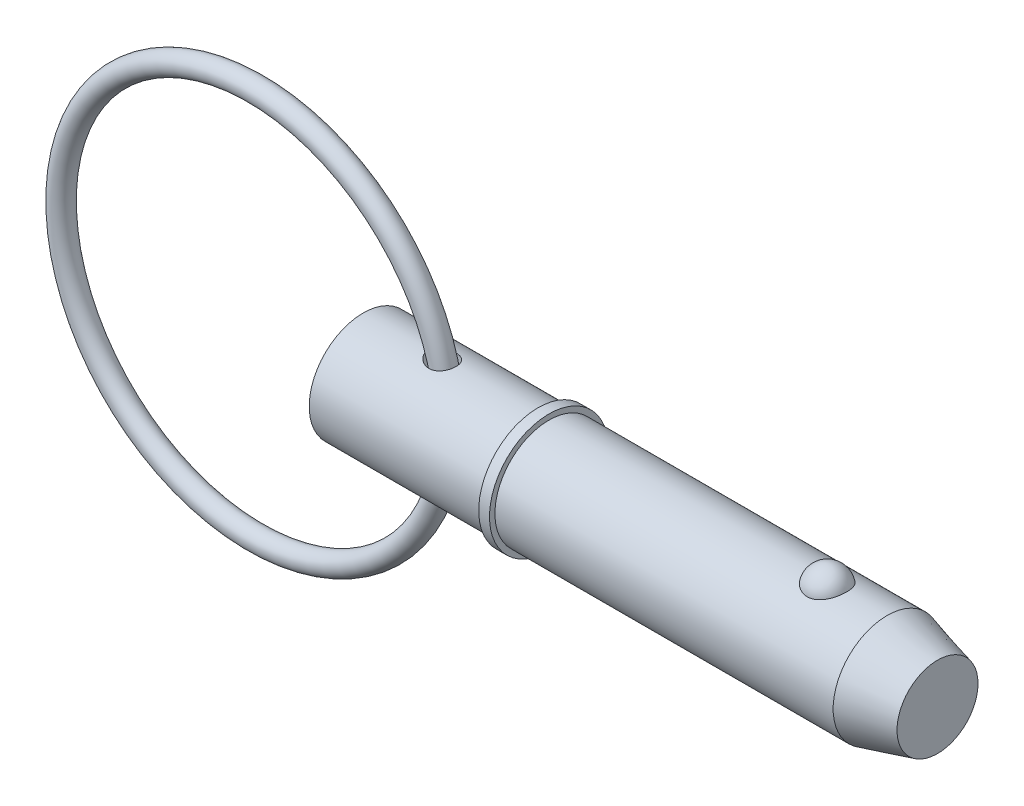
ISO-10303-21;
HEADER;
FILE_DESCRIPTION(('STEP AP214'),'2;1');
FILE_NAME('part.step','',(''),(''),'','','');
FILE_SCHEMA(('AUTOMOTIVE_DESIGN { 1 0 10303 214 1 1 1 1 }'));
ENDSEC;
DATA;
#1=APPLICATION_CONTEXT('core data for automotive mechanical design processes');
#2=APPLICATION_PROTOCOL_DEFINITION('international standard','automotive_design',2000,#1);
#3=PRODUCT_CONTEXT('',#1,'mechanical');
#4=PRODUCT('Part','Part','',(#3));
#5=PRODUCT_RELATED_PRODUCT_CATEGORY('part','',(#4));
#6=PRODUCT_DEFINITION_FORMATION('','',#4);
#7=PRODUCT_DEFINITION_CONTEXT('part definition',#1,'design');
#8=PRODUCT_DEFINITION('design','',#6,#7);
#9=PRODUCT_DEFINITION_SHAPE('','',#8);
#10=(LENGTH_UNIT() NAMED_UNIT(*) SI_UNIT(.MILLI.,.METRE.));
#11=(NAMED_UNIT(*) PLANE_ANGLE_UNIT() SI_UNIT($,.RADIAN.));
#12=(NAMED_UNIT(*) SI_UNIT($,.STERADIAN.) SOLID_ANGLE_UNIT());
#13=UNCERTAINTY_MEASURE_WITH_UNIT(LENGTH_MEASURE(1.E-05),#10,'distance_accuracy_value','');
#14=(GEOMETRIC_REPRESENTATION_CONTEXT(3) GLOBAL_UNCERTAINTY_ASSIGNED_CONTEXT((#13)) GLOBAL_UNIT_ASSIGNED_CONTEXT((#10,
#11,#12)) REPRESENTATION_CONTEXT('',''));
#15=CARTESIAN_POINT('',(0.,0.,0.));
#16=DIRECTION('',(0.,0.,1.));
#17=DIRECTION('',(1.,0.,0.));
#18=AXIS2_PLACEMENT_3D('',#15,#16,#17);
#19=CARTESIAN_POINT('',(-15.855506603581,0.,0.));
#20=DIRECTION('',(0.,0.,1.));
#21=DIRECTION('',(1.,0.,0.));
#22=AXIS2_PLACEMENT_3D('',#19,#20,#21);
#23=TOROIDAL_SURFACE('',#22,28.575,1.588);
#24=CARTESIAN_POINT('',(14.307493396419,0.,0.));
#25=VERTEX_POINT('',#24);
#26=VERTEX_LOOP('',#25);
#27=FACE_BOUND('',#26,.T.);
#28=ADVANCED_FACE('P0_F12',(#27),#23,.T.);
#29=CLOSED_SHELL('',(#28));
#30=MANIFOLD_SOLID_BREP('P0_B1',#29);
#31=CARTESIAN_POINT('',(0.,0.,0.));
#32=DIRECTION('',(1.,0.,0.));
#33=DIRECTION('',(0.,0.,-1.));
#34=AXIS2_PLACEMENT_3D('',#31,#32,#33);
#35=CYLINDRICAL_SURFACE('',#34,7.94);
#36=CARTESIAN_POINT('',(9.9064878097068,7.86092706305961,-1.11777712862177));
#37=CARTESIAN_POINT('',(9.98046148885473,7.84701054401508,-1.21564239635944));
#38=CARTESIAN_POINT('',(10.0632949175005,7.83217804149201,-1.30680329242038));
#39=CARTESIAN_POINT('',(10.243327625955,7.80247884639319,-1.47382688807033));
#40=CARTESIAN_POINT('',(10.3405572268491,7.78761214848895,-1.54965647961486));
#41=CARTESIAN_POINT('',(10.5460150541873,7.75960959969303,-1.6842723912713));
#42=CARTESIAN_POINT('',(10.654212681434,7.74646915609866,-1.74310445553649));
#43=CARTESIAN_POINT('',(10.8789333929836,7.72340979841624,-1.84259563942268));
#44=CARTESIAN_POINT('',(10.9954527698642,7.71348946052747,-1.88326279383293));
#45=CARTESIAN_POINT('',(11.2371543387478,7.69793327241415,-1.94589519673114));
#46=CARTESIAN_POINT('',(11.3624861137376,7.69242163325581,-1.96732022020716));
#47=CARTESIAN_POINT('',(11.6151110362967,7.68708151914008,-1.98809161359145));
#48=CARTESIAN_POINT('',(11.7424035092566,7.68725113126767,-1.98744541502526));
#49=CARTESIAN_POINT('',(11.9871377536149,7.69329740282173,-1.96389977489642));
#50=CARTESIAN_POINT('',(12.1047148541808,7.69883374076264,-1.94232728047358));
#51=CARTESIAN_POINT('',(12.3339179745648,7.7145667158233,-1.87886184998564));
#52=CARTESIAN_POINT('',(12.445546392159,7.72476145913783,-1.83697717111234));
#53=CARTESIAN_POINT('',(12.6521036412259,7.7477815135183,-1.73721211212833));
#54=CARTESIAN_POINT('',(12.7476463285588,7.76039274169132,-1.68054854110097));
#55=CARTESIAN_POINT('',(12.9274536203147,7.7871582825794,-1.55179691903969));
#56=CARTESIAN_POINT('',(13.0117191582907,7.8013124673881,-1.47971014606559));
#57=CARTESIAN_POINT('',(13.16544092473,7.82932755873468,-1.32341211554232));
#58=CARTESIAN_POINT('',(13.2351086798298,7.84318958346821,-1.23940873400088));
#59=CARTESIAN_POINT('',(13.3595610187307,7.86933512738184,-1.06080152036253));
#60=CARTESIAN_POINT('',(13.4143450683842,7.88161858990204,-0.966197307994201));
#61=CARTESIAN_POINT('',(13.5082288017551,7.90340571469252,-0.767990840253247));
#62=CARTESIAN_POINT('',(13.5471601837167,7.91287927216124,-0.664305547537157));
#63=CARTESIAN_POINT('',(13.6076213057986,7.92785679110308,-0.451705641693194));
#64=CARTESIAN_POINT('',(13.6291504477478,7.93336061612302,-0.342790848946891));
#65=CARTESIAN_POINT('',(13.6544025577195,7.93983472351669,-0.12204266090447));
#66=CARTESIAN_POINT('',(13.6580055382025,7.94077445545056,-0.0101946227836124));
#67=CARTESIAN_POINT('',(13.6469977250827,7.93793630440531,0.212542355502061));
#68=CARTESIAN_POINT('',(13.6323866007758,7.93415833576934,0.323431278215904));
#69=CARTESIAN_POINT('',(13.5852649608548,7.92228583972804,0.541194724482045));
#70=CARTESIAN_POINT('',(13.5527398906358,7.91418780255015,0.648065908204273));
#71=CARTESIAN_POINT('',(13.4705326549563,7.8945509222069,0.854658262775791));
#72=CARTESIAN_POINT('',(13.4208502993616,7.88301204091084,0.954379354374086));
#73=CARTESIAN_POINT('',(13.3056021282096,7.85778224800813,1.14366619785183));
#74=CARTESIAN_POINT('',(13.2400609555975,7.8440946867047,1.23324739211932));
#75=CARTESIAN_POINT('',(13.0946981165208,7.8160855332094,1.39984119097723));
#76=CARTESIAN_POINT('',(13.0148777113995,7.80176399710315,1.47685490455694));
#77=CARTESIAN_POINT('',(12.8438529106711,7.774237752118,1.61548556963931));
#78=CARTESIAN_POINT('',(12.7527554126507,7.76102428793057,1.67723263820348));
#79=CARTESIAN_POINT('',(12.5611987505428,7.73705789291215,1.78453696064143));
#80=CARTESIAN_POINT('',(12.4607407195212,7.72630466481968,1.83009617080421));
#81=CARTESIAN_POINT('',(12.2541997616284,7.70849465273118,1.90371822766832));
#82=CARTESIAN_POINT('',(12.1481665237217,7.7014098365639,1.93191408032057));
#83=CARTESIAN_POINT('',(11.9327851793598,7.69148605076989,1.97105353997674));
#84=CARTESIAN_POINT('',(11.8234367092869,7.68864754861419,1.98199524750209));
#85=CARTESIAN_POINT('',(11.6016024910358,7.68735890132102,1.98698770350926));
#86=CARTESIAN_POINT('',(11.4891069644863,7.68902083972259,1.98060702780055));
#87=CARTESIAN_POINT('',(11.2665484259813,7.6966276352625,1.95083303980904));
#88=CARTESIAN_POINT('',(11.1564861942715,7.70257384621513,1.92743434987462));
#89=CARTESIAN_POINT('',(10.9339966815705,7.71853798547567,1.86251478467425));
#90=CARTESIAN_POINT('',(10.8219140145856,7.72880438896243,1.81987394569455));
#91=CARTESIAN_POINT('',(10.6060441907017,7.75216432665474,1.7176403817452));
#92=CARTESIAN_POINT('',(10.5022611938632,7.76525926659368,1.65803922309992));
#93=CARTESIAN_POINT('',(10.3000447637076,7.79362794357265,1.51929354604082));
#94=CARTESIAN_POINT('',(10.2022480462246,7.80898310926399,1.43923272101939));
#95=CARTESIAN_POINT('',(10.0221668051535,7.83939672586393,1.26310118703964));
#96=CARTESIAN_POINT('',(9.93988168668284,7.85445518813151,1.16703109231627));
#97=CARTESIAN_POINT('',(9.79729823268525,7.88178950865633,0.964874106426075));
#98=CARTESIAN_POINT('',(9.73627994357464,7.89414970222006,0.859310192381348));
#99=CARTESIAN_POINT('',(9.63554001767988,7.91508909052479,0.638143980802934));
#100=CARTESIAN_POINT('',(9.59578986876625,7.92367334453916,0.522555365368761));
#101=CARTESIAN_POINT('',(9.54388714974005,7.93499161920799,0.300466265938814));
#102=CARTESIAN_POINT('',(9.52888458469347,7.93832727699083,0.194660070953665));
#103=CARTESIAN_POINT('',(9.51823078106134,7.94068976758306,-0.0179747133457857));
#104=CARTESIAN_POINT('',(9.52257317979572,7.93971801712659,-0.12480295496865));
#105=CARTESIAN_POINT('',(9.54911264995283,7.93386114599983,-0.326814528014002));
#106=CARTESIAN_POINT('',(9.56976509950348,7.92931471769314,-0.422217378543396));
#107=CARTESIAN_POINT('',(9.62591284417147,7.91721462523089,-0.608271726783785));
#108=CARTESIAN_POINT('',(9.66139801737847,7.90966301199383,-0.698926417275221));
#109=CARTESIAN_POINT('',(9.7317197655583,7.89515389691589,-0.844763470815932));
#110=CARTESIAN_POINT('',(9.76292633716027,7.88881879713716,-0.901801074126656));
#111=CARTESIAN_POINT('',(9.83075962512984,7.87538342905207,-1.01244242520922));
#112=CARTESIAN_POINT('',(9.86738597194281,7.86828321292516,-1.06604640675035));
#113=CARTESIAN_POINT('',(9.9064878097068,7.86092706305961,-1.11777712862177));
#114=B_SPLINE_CURVE_WITH_KNOTS('',3,(#36,#37,#38,#39,#40,#41,#42,#43,#44,#45,#46,#47,#48,#49,
#50,#51,#52,#53,#54,#55,#56,#57,#58,#59,#60,#61,#62,#63,#64,#65,#66,#67,#68,#69,#70,#71,#72,#73,
#74,#75,#76,#77,#78,#79,#80,#81,#82,#83,#84,#85,#86,#87,#88,#89,#90,#91,#92,#93,#94,#95,#96,#97,
#98,#99,#100,#101,#102,#103,#104,#105,#106,#107,#108,#109,#110,#111,#112,#113),.UNSPECIFIED.,
.T.,.F.,(4,2,2,2,2,2,2,2,2,2,2,2,2,2,2,2,2,2,2,2,2,2,2,2,2,2,2,2,2,2,2,2,2,2,2,2,2,2,4),(0.,
0.370138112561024,0.741067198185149,1.11098852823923,1.48074607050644,1.86058657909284,
2.24029919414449,2.59740885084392,2.95437345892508,3.2881332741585,3.6218654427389,
3.95036374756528,4.27887384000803,4.61078596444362,4.94270949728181,5.27685177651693,
5.61100012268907,5.94542035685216,6.27984429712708,6.61375187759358,6.94762997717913,
7.27855592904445,7.60944187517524,7.93776058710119,8.26611544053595,8.60272268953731,
8.93943635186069,9.29895306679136,9.65864886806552,10.0387340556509,10.4188046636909,
10.7843533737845,11.1494107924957,11.4683925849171,11.7872694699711,12.0791172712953,
12.3707662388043,12.5664313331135,12.7620830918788),.UNSPECIFIED.);
#115=CARTESIAN_POINT('',(9.9064878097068,7.86092706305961,-1.11777712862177));
#116=VERTEX_POINT('',#115);
#117=EDGE_CURVE('P1_E42',#116,#116,#114,.T.);
#118=ORIENTED_EDGE('',*,*,#117,.T.);
#119=EDGE_LOOP('',(#118));
#120=FACE_BOUND('',#119,.T.);
#121=CARTESIAN_POINT('',(0.,0.,0.));
#122=DIRECTION('',(1.,0.,0.));
#123=DIRECTION('',(0.,0.,-1.));
#124=AXIS2_PLACEMENT_3D('',#121,#122,#123);
#125=CIRCLE('',#124,7.94);
#126=CARTESIAN_POINT('',(0.,0.,-7.94));
#127=VERTEX_POINT('',#126);
#128=EDGE_CURVE('P1_E9',#127,#127,#125,.T.);
#129=ORIENTED_EDGE('',*,*,#128,.T.);
#130=EDGE_LOOP('',(#129));
#131=FACE_BOUND('',#130,.T.);
#132=CARTESIAN_POINT('',(25.722,0.,0.));
#133=DIRECTION('',(1.,0.,0.));
#134=DIRECTION('',(0.,0.,-1.));
#135=AXIS2_PLACEMENT_3D('',#132,#133,#134);
#136=CIRCLE('',#135,7.94);
#137=CARTESIAN_POINT('',(25.722,0.,-7.94));
#138=VERTEX_POINT('',#137);
#139=EDGE_CURVE('P1_E25',#138,#138,#136,.T.);
#140=ORIENTED_EDGE('',*,*,#139,.F.);
#141=EDGE_LOOP('',(#140));
#142=FACE_BOUND('',#141,.T.);
#143=CARTESIAN_POINT('',(9.9064878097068,-7.86092706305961,-1.11777712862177));
#144=CARTESIAN_POINT('',(9.84378768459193,-7.87272256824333,-1.03482250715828));
#145=CARTESIAN_POINT('',(9.7874122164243,-7.88386682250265,-0.947002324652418));
#146=CARTESIAN_POINT('',(9.68947008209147,-7.90377389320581,-0.763202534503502));
#147=CARTESIAN_POINT('',(9.64789384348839,-7.91253824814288,-0.667228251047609));
#148=CARTESIAN_POINT('',(9.58141396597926,-7.92676779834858,-0.468898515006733));
#149=CARTESIAN_POINT('',(9.55658638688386,-7.93221793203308,-0.366516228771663));
#150=CARTESIAN_POINT('',(9.525398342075,-7.9390896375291,-0.158837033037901));
#151=CARTESIAN_POINT('',(9.51903196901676,-7.94051249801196,-0.0535410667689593));
#152=CARTESIAN_POINT('',(9.5249639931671,-7.93919670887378,0.149856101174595));
#153=CARTESIAN_POINT('',(9.53611757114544,-7.9367132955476,0.247994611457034));
#154=CARTESIAN_POINT('',(9.57435037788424,-7.92833496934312,0.440949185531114));
#155=CARTESIAN_POINT('',(9.60143086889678,-7.92243978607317,0.535764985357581));
#156=CARTESIAN_POINT('',(9.67027872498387,-7.90782830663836,0.720026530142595));
#157=CARTESIAN_POINT('',(9.71210005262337,-7.89910165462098,0.809451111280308));
#158=CARTESIAN_POINT('',(9.80864905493,-7.87966534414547,0.980775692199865));
#159=CARTESIAN_POINT('',(9.86338092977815,-7.86895504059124,1.06267323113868));
#160=CARTESIAN_POINT('',(9.99009906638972,-7.84531573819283,1.22559225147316));
#161=CARTESIAN_POINT('',(10.0632770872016,-7.8322718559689,1.30566871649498));
#162=CARTESIAN_POINT('',(10.2208237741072,-7.80611237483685,1.45392159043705));
#163=CARTESIAN_POINT('',(10.3051986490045,-7.79299674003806,1.52209134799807));
#164=CARTESIAN_POINT('',(10.4935539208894,-7.76638841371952,1.65280871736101));
#165=CARTESIAN_POINT('',(10.5986730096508,-7.75303312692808,1.71374951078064));
#166=CARTESIAN_POINT('',(10.8175805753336,-7.72920597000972,1.81820073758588));
#167=CARTESIAN_POINT('',(10.9313721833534,-7.71873514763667,1.86170483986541));
#168=CARTESIAN_POINT('',(11.1696833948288,-7.70161777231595,1.93133079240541));
#169=CARTESIAN_POINT('',(11.2944525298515,-7.69514907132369,1.95665138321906));
#170=CARTESIAN_POINT('',(11.5466607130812,-7.6877908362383,1.98537345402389));
#171=CARTESIAN_POINT('',(11.6740986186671,-7.68689896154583,1.98878412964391));
#172=CARTESIAN_POINT('',(11.9206005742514,-7.690938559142,1.97309854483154));
#173=CARTESIAN_POINT('',(12.0397453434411,-7.69555832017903,1.95520713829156));
#174=CARTESIAN_POINT('',(12.2727177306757,-7.70968728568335,1.89872693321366));
#175=CARTESIAN_POINT('',(12.3865475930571,-7.71919440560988,1.86014695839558));
#176=CARTESIAN_POINT('',(12.5975118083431,-7.74115679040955,1.76641559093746));
#177=CARTESIAN_POINT('',(12.6952552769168,-7.75336701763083,1.71257254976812));
#178=CARTESIAN_POINT('',(12.8798510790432,-7.77962828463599,1.58901145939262));
#179=CARTESIAN_POINT('',(12.9667044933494,-7.79367914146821,1.51929498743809));
#180=CARTESIAN_POINT('',(13.1254818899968,-7.82172079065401,1.36751778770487));
#181=CARTESIAN_POINT('',(13.1976693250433,-7.83570718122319,1.28573131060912));
#182=CARTESIAN_POINT('',(13.3274495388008,-7.86236718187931,1.11111271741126));
#183=CARTESIAN_POINT('',(13.3850418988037,-7.87504075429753,1.01828028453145));
#184=CARTESIAN_POINT('',(13.4847470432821,-7.89782512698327,0.823214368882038));
#185=CARTESIAN_POINT('',(13.5267056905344,-7.90791011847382,0.720899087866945));
#186=CARTESIAN_POINT('',(13.5933891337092,-7.92427335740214,0.510509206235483));
#187=CARTESIAN_POINT('',(13.6181132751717,-7.9305514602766,0.402434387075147));
#188=CARTESIAN_POINT('',(13.6498843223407,-7.93866355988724,0.182728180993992));
#189=CARTESIAN_POINT('',(13.6567982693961,-7.94046412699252,0.07107630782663));
#190=CARTESIAN_POINT('',(13.6524060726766,-7.93933046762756,-0.151845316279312));
#191=CARTESIAN_POINT('',(13.6410996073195,-7.93639615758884,-0.26311506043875));
#192=CARTESIAN_POINT('',(13.6005023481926,-7.92610202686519,-0.482238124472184));
#193=CARTESIAN_POINT('',(13.571192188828,-7.91873744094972,-0.590087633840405));
#194=CARTESIAN_POINT('',(13.495246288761,-7.90037565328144,-0.799178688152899));
#195=CARTESIAN_POINT('',(13.4486102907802,-7.88937839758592,-0.900420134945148));
#196=CARTESIAN_POINT('',(13.3391817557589,-7.86497175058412,-1.09328280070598));
#197=CARTESIAN_POINT('',(13.2764083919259,-7.85156522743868,-1.18491525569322));
#198=CARTESIAN_POINT('',(13.1362355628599,-7.8238261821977,-1.35604994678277));
#199=CARTESIAN_POINT('',(13.0588372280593,-7.80949373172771,-1.43555311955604));
#200=CARTESIAN_POINT('',(12.8921392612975,-7.78164292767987,-1.57955181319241));
#201=CARTESIAN_POINT('',(12.8029410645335,-7.76811892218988,-1.64416363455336));
#202=CARTESIAN_POINT('',(12.6146622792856,-7.74328422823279,-1.75742016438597));
#203=CARTESIAN_POINT('',(12.5155829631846,-7.73197325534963,-1.80606692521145));
#204=CARTESIAN_POINT('',(12.31135301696,-7.71289290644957,-1.88588502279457));
#205=CARTESIAN_POINT('',(12.2062651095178,-7.70509254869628,-1.91720981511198));
#206=CARTESIAN_POINT('',(11.9922253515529,-7.69365188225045,-1.96261878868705));
#207=CARTESIAN_POINT('',(11.8832731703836,-7.69001193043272,-1.97670149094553));
#208=CARTESIAN_POINT('',(11.662174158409,-7.6871142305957,-1.98794112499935));
#209=CARTESIAN_POINT('',(11.5500082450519,-7.6879499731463,-1.98473694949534));
#210=CARTESIAN_POINT('',(11.3276038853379,-7.69396349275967,-1.96129119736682));
#211=CARTESIAN_POINT('',(11.2173659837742,-7.6991424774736,-1.94104488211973));
#212=CARTESIAN_POINT('',(10.9943151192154,-7.71363470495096,-1.8826578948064));
#213=CARTESIAN_POINT('',(10.8818004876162,-7.72319478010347,-1.8434396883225));
#214=CARTESIAN_POINT('',(10.6644693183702,-7.74534199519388,-1.74804607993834));
#215=CARTESIAN_POINT('',(10.5596578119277,-7.75793109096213,-1.69185971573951));
#216=CARTESIAN_POINT('',(10.3538333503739,-7.78563853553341,-1.5595801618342));
#217=CARTESIAN_POINT('',(10.2535123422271,-7.80086820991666,-1.48242881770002));
#218=CARTESIAN_POINT('',(10.0678634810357,-7.83136022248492,-1.31182139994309));
#219=CARTESIAN_POINT('',(9.98252491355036,-7.84662252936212,-1.21837707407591));
#220=CARTESIAN_POINT('',(9.9064878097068,-7.86092706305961,-1.11777712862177));
#221=B_SPLINE_CURVE_WITH_KNOTS('',3,(#143,#144,#145,#146,#147,#148,#149,#150,#151,#152,#153,
#154,#155,#156,#157,#158,#159,#160,#161,#162,#163,#164,#165,#166,#167,#168,#169,#170,#171,#172,
#173,#174,#175,#176,#177,#178,#179,#180,#181,#182,#183,#184,#185,#186,#187,#188,#189,#190,#191,
#192,#193,#194,#195,#196,#197,#198,#199,#200,#201,#202,#203,#204,#205,#206,#207,#208,#209,#210,
#211,#212,#213,#214,#215,#216,#217,#218,#219,#220),.UNSPECIFIED.,.T.,.F.,(4,2,2,2,2,2,2,2,2,2,2,
2,2,2,2,2,2,2,2,2,2,2,2,2,2,2,2,2,2,2,2,2,2,2,2,2,2,2,4),(0.,0.313593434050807,
0.626983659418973,0.941787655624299,1.25649090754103,1.55146990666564,1.84647228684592,
2.14256601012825,2.4387561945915,2.76521830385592,3.09186220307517,3.45696288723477,
3.82219601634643,4.20267276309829,4.58298981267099,4.94277962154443,5.30241610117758,
5.63754619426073,5.97264300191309,6.301049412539,6.62946524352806,6.96103833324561,
7.29262401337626,7.62667800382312,7.96073789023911,8.29515773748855,8.6295825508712,
8.96361184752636,9.29761533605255,9.62891449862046,9.96017105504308,10.288443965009,
10.616745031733,10.951930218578,11.2872086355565,11.6442788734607,12.0015802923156,
12.3821516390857,12.762449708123),.UNSPECIFIED.);
#222=CARTESIAN_POINT('',(9.9064878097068,-7.86092706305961,-1.11777712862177));
#223=VERTEX_POINT('',#222);
#224=EDGE_CURVE('P1_E17',#223,#223,#221,.T.);
#225=ORIENTED_EDGE('',*,*,#224,.T.);
#226=EDGE_LOOP('',(#225));
#227=FACE_BOUND('',#226,.T.);
#228=ADVANCED_FACE('P1_F13',(#120,#131,#142,#227),#35,.T.);
#229=CARTESIAN_POINT('',(0.,0.,0.));
#230=DIRECTION('',(1.,0.,0.));
#231=DIRECTION('',(0.,0.,-1.));
#232=AXIS2_PLACEMENT_3D('',#229,#230,#231);
#233=CYLINDRICAL_SURFACE('',#232,7.94);
#234=CARTESIAN_POINT('',(77.0518791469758,0.,0.));
#235=DIRECTION('',(1.,0.,0.));
#236=DIRECTION('',(0.,0.,-1.));
#237=AXIS2_PLACEMENT_3D('',#234,#235,#236);
#238=CIRCLE('',#237,7.94);
#239=CARTESIAN_POINT('',(77.0518791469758,0.,-7.94));
#240=VERTEX_POINT('',#239);
#241=EDGE_CURVE('P1_E99',#240,#240,#238,.T.);
#242=ORIENTED_EDGE('',*,*,#241,.F.);
#243=EDGE_LOOP('',(#242));
#244=FACE_BOUND('',#243,.T.);
#245=CARTESIAN_POINT('',(27.31,0.,0.));
#246=DIRECTION('',(1.,0.,0.));
#247=DIRECTION('',(0.,0.,-1.));
#248=AXIS2_PLACEMENT_3D('',#245,#246,#247);
#249=CIRCLE('',#248,7.94);
#250=CARTESIAN_POINT('',(27.31,0.,-7.94));
#251=VERTEX_POINT('',#250);
#252=EDGE_CURVE('P1_E96',#251,#251,#249,.T.);
#253=ORIENTED_EDGE('',*,*,#252,.T.);
#254=EDGE_LOOP('',(#253));
#255=FACE_BOUND('',#254,.T.);
#256=CARTESIAN_POINT('',(68.2449074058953,7.37767842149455,2.93486986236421));
#257=CARTESIAN_POINT('',(68.0927496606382,7.3776732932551,2.93487505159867));
#258=CARTESIAN_POINT('',(67.9406329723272,7.38258419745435,2.92262454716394));
#259=CARTESIAN_POINT('',(67.6409284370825,7.40163229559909,2.87404196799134));
#260=CARTESIAN_POINT('',(67.4933394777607,7.41576720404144,2.83771585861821));
#261=CARTESIAN_POINT('',(67.2070187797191,7.4516157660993,2.74218769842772));
#262=CARTESIAN_POINT('',(67.0682745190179,7.47331841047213,2.68301886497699));
#263=CARTESIAN_POINT('',(66.8028822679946,7.52194082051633,2.5435096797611));
#264=CARTESIAN_POINT('',(66.6762366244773,7.5488615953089,2.46316523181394));
#265=CARTESIAN_POINT('',(66.4345349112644,7.60594671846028,2.28090375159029));
#266=CARTESIAN_POINT('',(66.3199065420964,7.63618114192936,2.17844211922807));
#267=CARTESIAN_POINT('',(66.1088787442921,7.69614046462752,1.95608495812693));
#268=CARTESIAN_POINT('',(66.0124826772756,7.72586526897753,1.83618622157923));
#269=CARTESIAN_POINT('',(65.8359381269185,7.78314821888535,1.57628086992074));
#270=CARTESIAN_POINT('',(65.7567072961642,7.81055035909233,1.43561546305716));
#271=CARTESIAN_POINT('',(65.6217979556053,7.85879631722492,1.14236334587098));
#272=CARTESIAN_POINT('',(65.5661216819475,7.87963951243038,0.989775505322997));
#273=CARTESIAN_POINT('',(65.4788121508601,7.91289645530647,0.674619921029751));
#274=CARTESIAN_POINT('',(65.4475309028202,7.925186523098,0.511941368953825));
#275=CARTESIAN_POINT('',(65.410975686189,7.93958930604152,0.183247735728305));
#276=CARTESIAN_POINT('',(65.4057012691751,7.94170219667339,0.0172327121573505));
#277=CARTESIAN_POINT('',(65.4212311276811,7.93554931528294,-0.312672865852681));
#278=CARTESIAN_POINT('',(65.4419253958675,7.92732732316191,-0.476569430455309));
#279=CARTESIAN_POINT('',(65.5087865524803,7.90141534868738,-0.798305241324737));
#280=CARTESIAN_POINT('',(65.5549539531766,7.88372517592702,-0.956144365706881));
#281=CARTESIAN_POINT('',(65.6718986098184,7.84066230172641,-1.26152073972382));
#282=CARTESIAN_POINT('',(65.7427046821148,7.81528060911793,-1.40904568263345));
#283=CARTESIAN_POINT('',(65.9074789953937,7.7594867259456,-1.68950598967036));
#284=CARTESIAN_POINT('',(66.0014488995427,7.72907417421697,-1.82244030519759));
#285=CARTESIAN_POINT('',(66.2108391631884,7.66640424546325,-2.07032792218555));
#286=CARTESIAN_POINT('',(66.3263152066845,7.63414223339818,-2.1852330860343));
#287=CARTESIAN_POINT('',(66.5759006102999,7.57149681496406,-2.39329737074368));
#288=CARTESIAN_POINT('',(66.7100080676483,7.54111321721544,-2.48645870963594));
#289=CARTESIAN_POINT('',(66.9901113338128,7.48650742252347,-2.64628132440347));
#290=CARTESIAN_POINT('',(67.1357605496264,7.46215900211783,-2.71350554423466));
#291=CARTESIAN_POINT('',(67.4374259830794,7.42171253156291,-2.82226614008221));
#292=CARTESIAN_POINT('',(67.5934383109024,7.40561140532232,-2.86381209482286));
#293=CARTESIAN_POINT('',(67.9029708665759,7.38426796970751,-2.91839077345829));
#294=CARTESIAN_POINT('',(68.0562229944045,7.37852109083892,-2.93275024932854));
#295=CARTESIAN_POINT('',(68.3630705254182,7.37700973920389,-2.9365520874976));
#296=CARTESIAN_POINT('',(68.5166658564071,7.38124333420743,-2.92599927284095));
#297=CARTESIAN_POINT('',(68.8149907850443,7.39890635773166,-2.88102897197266));
#298=CARTESIAN_POINT('',(68.9598480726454,7.41205491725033,-2.84733999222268));
#299=CARTESIAN_POINT('',(69.2416432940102,7.44580110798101,-2.75788206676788));
#300=CARTESIAN_POINT('',(69.3785805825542,7.46639934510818,-2.70211132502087));
#301=CARTESIAN_POINT('',(69.6440619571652,7.51339098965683,-2.56858908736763));
#302=CARTESIAN_POINT('',(69.7723548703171,7.53990200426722,-2.49038067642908));
#303=CARTESIAN_POINT('',(70.0142440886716,7.59569503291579,-2.31462737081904));
#304=CARTESIAN_POINT('',(70.1278370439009,7.62497767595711,-2.21707808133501));
#305=CARTESIAN_POINT('',(70.34322156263,7.68489473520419,-1.99982049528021));
#306=CARTESIAN_POINT('',(70.4441488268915,7.71552419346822,-1.87925337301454));
#307=CARTESIAN_POINT('',(70.6251866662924,7.77353016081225,-1.62268826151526));
#308=CARTESIAN_POINT('',(70.7052934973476,7.80090608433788,-1.48668750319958));
#309=CARTESIAN_POINT('',(70.8453615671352,7.85047992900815,-1.19818413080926));
#310=CARTESIAN_POINT('',(70.9045877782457,7.8724818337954,-1.04529016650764));
#311=CARTESIAN_POINT('',(70.9979821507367,7.90785114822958,-0.731080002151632));
#312=CARTESIAN_POINT('',(71.0321497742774,7.92121837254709,-0.569763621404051));
#313=CARTESIAN_POINT('',(71.074795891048,7.93797834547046,-0.242812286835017));
#314=CARTESIAN_POINT('',(71.0832047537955,7.94134405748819,-0.0771668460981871));
#315=CARTESIAN_POINT('',(71.0739626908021,7.93767937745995,0.253276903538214));
#316=CARTESIAN_POINT('',(71.0563120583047,7.93064910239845,0.418075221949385));
#317=CARTESIAN_POINT('',(70.9954247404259,7.90695571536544,0.741525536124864));
#318=CARTESIAN_POINT('',(70.9522819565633,7.8903279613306,0.90019782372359));
#319=CARTESIAN_POINT('',(70.8413535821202,7.84916386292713,1.20759654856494));
#320=CARTESIAN_POINT('',(70.7735665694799,7.82462706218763,1.35632241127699));
#321=CARTESIAN_POINT('',(70.6143718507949,7.7700669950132,1.64032869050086));
#322=CARTESIAN_POINT('',(70.5228616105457,7.7400200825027,1.77554712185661));
#323=CARTESIAN_POINT('',(70.3182960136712,7.67774175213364,2.02800648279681));
#324=CARTESIAN_POINT('',(70.2052410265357,7.64551037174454,2.14524772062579));
#325=CARTESIAN_POINT('',(69.9608318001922,7.58265895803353,2.35778002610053));
#326=CARTESIAN_POINT('',(69.8295833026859,7.5520309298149,2.45319004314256));
#327=CARTESIAN_POINT('',(69.551601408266,7.49579792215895,2.61999897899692));
#328=CARTESIAN_POINT('',(69.4048670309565,7.4701932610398,2.69139637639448));
#329=CARTESIAN_POINT('',(69.0929477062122,7.42622216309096,2.81053241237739));
#330=CARTESIAN_POINT('',(68.9272209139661,7.40825002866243,2.85700910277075));
#331=CARTESIAN_POINT('',(68.5892792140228,7.38398348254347,2.91916850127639));
#332=CARTESIAN_POINT('',(68.4170670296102,7.37768422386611,2.93486399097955));
#333=CARTESIAN_POINT('',(68.2449074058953,7.37767842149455,2.93486986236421));
#334=B_SPLINE_CURVE_WITH_KNOTS('',3,(#256,#257,#258,#259,#260,#261,#262,#263,#264,#265,#266,
#267,#268,#269,#270,#271,#272,#273,#274,#275,#276,#277,#278,#279,#280,#281,#282,#283,#284,#285,
#286,#287,#288,#289,#290,#291,#292,#293,#294,#295,#296,#297,#298,#299,#300,#301,#302,#303,#304,
#305,#306,#307,#308,#309,#310,#311,#312,#313,#314,#315,#316,#317,#318,#319,#320,#321,#322,#323,
#324,#325,#326,#327,#328,#329,#330,#331,#332,#333),.UNSPECIFIED.,.T.,.F.,(4,2,2,2,2,2,2,2,2,2,2,
2,2,2,2,2,2,2,2,2,2,2,2,2,2,2,2,2,2,2,2,2,2,2,2,2,2,2,4),(0.,0.455841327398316,
0.911569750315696,1.36663794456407,1.8217942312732,2.28978983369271,2.75787163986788,
3.24685368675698,3.73588214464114,4.23184282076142,4.72779494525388,5.22165321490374,
5.71552141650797,6.20996917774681,6.70445245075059,7.20023431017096,7.69596557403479,
8.18023418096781,8.66432203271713,9.12410697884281,9.58380291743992,10.0296503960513,
10.4755341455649,10.9312349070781,11.3870393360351,11.8654416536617,12.343929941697,
12.837887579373,13.3318558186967,13.8271581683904,14.3224549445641,14.8159385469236,
15.309450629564,15.8051323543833,16.3008055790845,16.7937101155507,17.2866458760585,
17.8026240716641,18.3183879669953),.UNSPECIFIED.);
#335=CARTESIAN_POINT('',(68.2449074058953,7.37767842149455,2.93486986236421));
#336=VERTEX_POINT('',#335);
#337=EDGE_CURVE('P1_E34',#336,#336,#334,.T.);
#338=ORIENTED_EDGE('',*,*,#337,.T.);
#339=EDGE_LOOP('',(#338));
#340=FACE_BOUND('',#339,.T.);
#341=ADVANCED_FACE('P1_F46',(#244,#255,#340),#233,.T.);
#342=CARTESIAN_POINT('',(0.,0.,0.));
#343=DIRECTION('',(-1.,0.,0.));
#344=DIRECTION('',(0.,0.,1.));
#345=AXIS2_PLACEMENT_3D('',#342,#343,#344);
#346=PLANE('',#345);
#347=ORIENTED_EDGE('',*,*,#128,.F.);
#348=EDGE_LOOP('',(#347));
#349=FACE_BOUND('',#348,.T.);
#350=ADVANCED_FACE('P1_F15',(#349),#346,.T.);
#351=CARTESIAN_POINT('',(25.722,7.94,0.));
#352=DIRECTION('',(-1.,0.,0.));
#353=DIRECTION('',(0.,0.,1.));
#354=AXIS2_PLACEMENT_3D('',#351,#352,#353);
#355=PLANE('',#354);
#356=ORIENTED_EDGE('',*,*,#139,.T.);
#357=EDGE_LOOP('',(#356));
#358=FACE_BOUND('',#357,.T.);
#359=CARTESIAN_POINT('',(25.722,0.,0.));
#360=DIRECTION('',(1.,0.,0.));
#361=DIRECTION('',(0.,0.,-1.));
#362=AXIS2_PLACEMENT_3D('',#359,#360,#361);
#363=CIRCLE('',#362,8.734);
#364=CARTESIAN_POINT('',(25.722,0.,-8.734));
#365=VERTEX_POINT('',#364);
#366=EDGE_CURVE('P1_E30',#365,#365,#363,.T.);
#367=ORIENTED_EDGE('',*,*,#366,.F.);
#368=EDGE_LOOP('',(#367));
#369=FACE_BOUND('',#368,.T.);
#370=ADVANCED_FACE('P1_F81',(#358,#369),#355,.T.);
#371=CARTESIAN_POINT('',(0.,0.,0.));
#372=DIRECTION('',(1.,0.,0.));
#373=DIRECTION('',(0.,0.,-1.));
#374=AXIS2_PLACEMENT_3D('',#371,#372,#373);
#375=CYLINDRICAL_SURFACE('',#374,8.734);
#376=ORIENTED_EDGE('',*,*,#366,.T.);
#377=EDGE_LOOP('',(#376));
#378=FACE_BOUND('',#377,.T.);
#379=CARTESIAN_POINT('',(27.31,0.,0.));
#380=DIRECTION('',(1.,0.,0.));
#381=DIRECTION('',(0.,0.,-1.));
#382=AXIS2_PLACEMENT_3D('',#379,#380,#381);
#383=CIRCLE('',#382,8.734);
#384=CARTESIAN_POINT('',(27.31,0.,-8.734));
#385=VERTEX_POINT('',#384);
#386=EDGE_CURVE('P1_E95',#385,#385,#383,.T.);
#387=ORIENTED_EDGE('',*,*,#386,.F.);
#388=EDGE_LOOP('',(#387));
#389=FACE_BOUND('',#388,.T.);
#390=ADVANCED_FACE('P1_F68',(#378,#389),#375,.T.);
#391=CARTESIAN_POINT('',(27.31,8.734,0.));
#392=DIRECTION('',(1.,0.,0.));
#393=DIRECTION('',(0.,0.,-1.));
#394=AXIS2_PLACEMENT_3D('',#391,#392,#393);
#395=PLANE('',#394);
#396=ORIENTED_EDGE('',*,*,#386,.T.);
#397=EDGE_LOOP('',(#396));
#398=FACE_BOUND('',#397,.T.);
#399=ORIENTED_EDGE('',*,*,#252,.F.);
#400=EDGE_LOOP('',(#399));
#401=FACE_BOUND('',#400,.T.);
#402=ADVANCED_FACE('P1_F62',(#398,#401),#395,.T.);
#403=CARTESIAN_POINT('',(84.46,0.,0.));
#404=DIRECTION('',(-1.,0.,0.));
#405=DIRECTION('',(0.,0.,1.));
#406=AXIS2_PLACEMENT_3D('',#403,#404,#405);
#407=CONICAL_SURFACE('',#406,5.95500000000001,0.26179938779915);
#408=ORIENTED_EDGE('',*,*,#241,.T.);
#409=EDGE_LOOP('',(#408));
#410=FACE_BOUND('',#409,.T.);
#411=CARTESIAN_POINT('',(84.46,0.,0.));
#412=DIRECTION('',(1.,0.,0.));
#413=DIRECTION('',(0.,0.,-1.));
#414=AXIS2_PLACEMENT_3D('',#411,#412,#413);
#415=CIRCLE('',#414,5.95500000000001);
#416=CARTESIAN_POINT('',(84.46,0.,-5.95500000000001));
#417=VERTEX_POINT('',#416);
#418=EDGE_CURVE('P1_E41',#417,#417,#415,.T.);
#419=ORIENTED_EDGE('',*,*,#418,.F.);
#420=EDGE_LOOP('',(#419));
#421=FACE_BOUND('',#420,.T.);
#422=ADVANCED_FACE('P1_F59',(#410,#421),#407,.T.);
#423=CARTESIAN_POINT('',(84.46,5.95500000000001,0.));
#424=DIRECTION('',(1.,0.,0.));
#425=DIRECTION('',(0.,0.,-1.));
#426=AXIS2_PLACEMENT_3D('',#423,#424,#425);
#427=PLANE('',#426);
#428=ORIENTED_EDGE('',*,*,#418,.T.);
#429=EDGE_LOOP('',(#428));
#430=FACE_BOUND('',#429,.T.);
#431=ADVANCED_FACE('P1_F55',(#430),#427,.T.);
#432=CARTESIAN_POINT('',(68.2449074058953,7.146,0.));
#433=DIRECTION('',(-1.,0.,0.));
#434=DIRECTION('',(0.,1.,0.));
#435=AXIS2_PLACEMENT_3D('',#432,#433,#434);
#436=SPHERICAL_SURFACE('',#435,2.94399999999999);
#437=ORIENTED_EDGE('',*,*,#337,.F.);
#438=EDGE_LOOP('',(#437));
#439=FACE_BOUND('',#438,.T.);
#440=ADVANCED_FACE('P1_F50',(#439),#436,.T.);
#441=CARTESIAN_POINT('',(-15.855506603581,0.,0.));
#442=DIRECTION('',(0.,0.,1.));
#443=DIRECTION('',(1.,0.,0.));
#444=AXIS2_PLACEMENT_3D('',#441,#442,#443);
#445=TOROIDAL_SURFACE('',#444,28.575,1.985);
#446=ORIENTED_EDGE('',*,*,#224,.F.);
#447=EDGE_LOOP('',(#446));
#448=FACE_BOUND('',#447,.T.);
#449=ORIENTED_EDGE('',*,*,#117,.F.);
#450=EDGE_LOOP('',(#449));
#451=FACE_BOUND('',#450,.T.);
#452=ADVANCED_FACE('P1_F54',(#448,#451),#445,.F.);
#453=CLOSED_SHELL('',(#228,#341,#350,#370,#390,#402,#422,#431,#440,#452));
#454=MANIFOLD_SOLID_BREP('P1_B1',#453);
#455=ADVANCED_BREP_SHAPE_REPRESENTATION('',(#18,#30,#454),#14);
#456=SHAPE_DEFINITION_REPRESENTATION(#9,#455);
ENDSEC;
END-ISO-10303-21;
